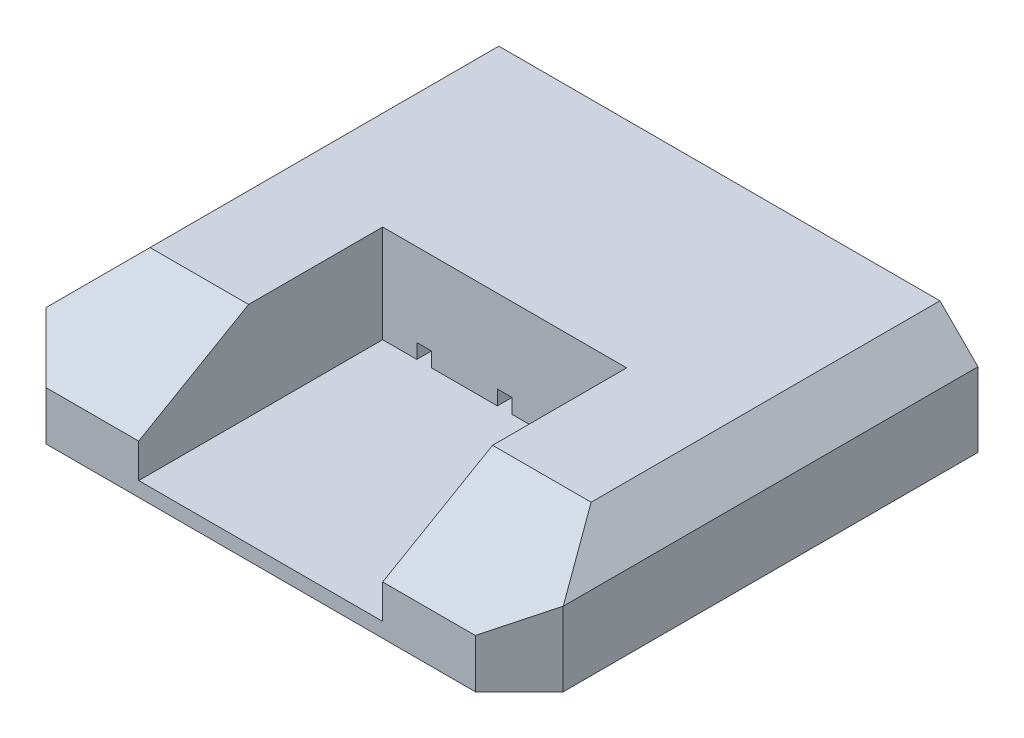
ISO-10303-21;
HEADER;
FILE_DESCRIPTION(('STEP AP214'),'2;1');
FILE_NAME('part.step','',(''),(''),'','','');
FILE_SCHEMA(('AUTOMOTIVE_DESIGN { 1 0 10303 214 1 1 1 1 }'));
ENDSEC;
DATA;
#1=APPLICATION_CONTEXT('core data for automotive mechanical design processes');
#2=APPLICATION_PROTOCOL_DEFINITION('international standard','automotive_design',2000,#1);
#3=PRODUCT_CONTEXT('',#1,'mechanical');
#4=PRODUCT('Part','Part','',(#3));
#5=PRODUCT_RELATED_PRODUCT_CATEGORY('part','',(#4));
#6=PRODUCT_DEFINITION_FORMATION('','',#4);
#7=PRODUCT_DEFINITION_CONTEXT('part definition',#1,'design');
#8=PRODUCT_DEFINITION('design','',#6,#7);
#9=PRODUCT_DEFINITION_SHAPE('','',#8);
#10=(LENGTH_UNIT() NAMED_UNIT(*) SI_UNIT(.MILLI.,.METRE.));
#11=(NAMED_UNIT(*) PLANE_ANGLE_UNIT() SI_UNIT($,.RADIAN.));
#12=(NAMED_UNIT(*) SI_UNIT($,.STERADIAN.) SOLID_ANGLE_UNIT());
#13=UNCERTAINTY_MEASURE_WITH_UNIT(LENGTH_MEASURE(1.E-05),#10,'distance_accuracy_value','');
#14=(GEOMETRIC_REPRESENTATION_CONTEXT(3) GLOBAL_UNCERTAINTY_ASSIGNED_CONTEXT((#13)) GLOBAL_UNIT_ASSIGNED_CONTEXT((#10,
#11,#12)) REPRESENTATION_CONTEXT('',''));
#15=CARTESIAN_POINT('',(0.,0.,0.));
#16=DIRECTION('',(0.,0.,1.));
#17=DIRECTION('',(1.,0.,0.));
#18=AXIS2_PLACEMENT_3D('',#15,#16,#17);
#19=CARTESIAN_POINT('',(530.,230.,470.));
#20=DIRECTION('',(-1.,0.,0.));
#21=DIRECTION('',(0.,0.,1.));
#22=AXIS2_PLACEMENT_3D('',#19,#20,#21);
#23=PLANE('',#22);
#24=DIRECTION('',(0.,-1.,0.));
#25=VECTOR('',#24,1.);
#26=CARTESIAN_POINT('',(530.,230.,-470.));
#27=LINE('',#26,#25);
#28=CARTESIAN_POINT('',(530.,152.,-470.));
#29=VERTEX_POINT('',#28);
#30=CARTESIAN_POINT('',(530.,0.,-470.));
#31=VERTEX_POINT('',#30);
#32=EDGE_CURVE('E359',#29,#31,#27,.T.);
#33=ORIENTED_EDGE('',*,*,#32,.F.);
#34=DIRECTION('',(0.,0.,1.));
#35=VECTOR('',#34,1.);
#36=CARTESIAN_POINT('',(530.,152.,470.));
#37=LINE('',#36,#35);
#38=CARTESIAN_POINT('',(530.,152.,379.933358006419));
#39=VERTEX_POINT('',#38);
#40=EDGE_CURVE('E52',#29,#39,#37,.T.);
#41=ORIENTED_EDGE('',*,*,#40,.T.);
#42=DIRECTION('',(0.,0.500000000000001,-0.866025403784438));
#43=VECTOR('',#42,1.);
#44=CARTESIAN_POINT('',(530.,230.,244.833395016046));
#45=LINE('',#44,#43);
#46=CARTESIAN_POINT('',(530.,151.961524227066,380.));
#47=VERTEX_POINT('',#46);
#48=EDGE_CURVE('E391',#39,#47,#45,.F.);
#49=ORIENTED_EDGE('',*,*,#48,.T.);
#50=DIRECTION('',(0.,-1.,0.));
#51=VECTOR('',#50,1.);
#52=CARTESIAN_POINT('',(530.,230.,380.));
#53=LINE('',#52,#51);
#54=CARTESIAN_POINT('',(530.,0.,380.));
#55=VERTEX_POINT('',#54);
#56=EDGE_CURVE('E373',#47,#55,#53,.T.);
#57=ORIENTED_EDGE('',*,*,#56,.T.);
#58=DIRECTION('',(0.,0.,-1.));
#59=VECTOR('',#58,1.);
#60=CARTESIAN_POINT('',(530.,0.,470.));
#61=LINE('',#60,#59);
#62=EDGE_CURVE('E335',#55,#31,#61,.T.);
#63=ORIENTED_EDGE('',*,*,#62,.T.);
#64=EDGE_LOOP('',(#33,#41,#49,#57,#63));
#65=FACE_BOUND('',#64,.T.);
#66=ADVANCED_FACE('F43',(#65),#23,.F.);
#67=CARTESIAN_POINT('',(-530.,230.,-470.));
#68=DIRECTION('',(0.,0.,1.));
#69=DIRECTION('',(1.,0.,0.));
#70=AXIS2_PLACEMENT_3D('',#67,#68,#69);
#71=PLANE('',#70);
#72=DIRECTION('',(0.,-1.,0.));
#73=VECTOR('',#72,1.);
#74=CARTESIAN_POINT('',(-530.,230.,-470.));
#75=LINE('',#74,#73);
#76=CARTESIAN_POINT('',(-530.,152.,-470.));
#77=VERTEX_POINT('',#76);
#78=CARTESIAN_POINT('',(-530.,0.,-470.));
#79=VERTEX_POINT('',#78);
#80=EDGE_CURVE('E346',#77,#79,#75,.T.);
#81=ORIENTED_EDGE('',*,*,#80,.F.);
#82=DIRECTION('',(-0.707106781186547,-0.707106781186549,0.));
#83=VECTOR('',#82,1.);
#84=CARTESIAN_POINT('',(-452.,230.,-470.));
#85=LINE('',#84,#83);
#86=CARTESIAN_POINT('',(-452.,230.,-470.));
#87=VERTEX_POINT('',#86);
#88=EDGE_CURVE('E409',#77,#87,#85,.F.);
#89=ORIENTED_EDGE('',*,*,#88,.T.);
#90=DIRECTION('',(-1.,0.,0.));
#91=VECTOR('',#90,1.);
#92=CARTESIAN_POINT('',(-530.,230.,-470.));
#93=LINE('',#92,#91);
#94=CARTESIAN_POINT('',(452.,230.,-470.));
#95=VERTEX_POINT('',#94);
#96=EDGE_CURVE('E343',#95,#87,#93,.T.);
#97=ORIENTED_EDGE('',*,*,#96,.F.);
#98=DIRECTION('',(-0.707106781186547,0.707106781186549,0.));
#99=VECTOR('',#98,1.);
#100=CARTESIAN_POINT('',(452.,230.,-470.));
#101=LINE('',#100,#99);
#102=EDGE_CURVE('E407',#95,#29,#101,.F.);
#103=ORIENTED_EDGE('',*,*,#102,.T.);
#104=ORIENTED_EDGE('',*,*,#32,.T.);
#105=DIRECTION('',(-1.,0.,0.));
#106=VECTOR('',#105,1.);
#107=CARTESIAN_POINT('',(-530.,0.,-470.));
#108=LINE('',#107,#106);
#109=EDGE_CURVE('E350',#31,#79,#108,.T.);
#110=ORIENTED_EDGE('',*,*,#109,.T.);
#111=EDGE_LOOP('',(#81,#89,#97,#103,#104,#110));
#112=FACE_BOUND('',#111,.T.);
#113=ADVANCED_FACE('F430',(#112),#71,.F.);
#114=CARTESIAN_POINT('',(-530.,230.,470.));
#115=DIRECTION('',(1.,0.,0.));
#116=DIRECTION('',(0.,0.,-1.));
#117=AXIS2_PLACEMENT_3D('',#114,#115,#116);
#118=PLANE('',#117);
#119=DIRECTION('',(0.,-0.500000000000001,0.866025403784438));
#120=VECTOR('',#119,1.);
#121=CARTESIAN_POINT('',(-530.,230.,244.833395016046));
#122=LINE('',#121,#120);
#123=CARTESIAN_POINT('',(-530.,151.961524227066,380.));
#124=VERTEX_POINT('',#123);
#125=CARTESIAN_POINT('',(-530.,152.,379.933358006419));
#126=VERTEX_POINT('',#125);
#127=EDGE_CURVE('E388',#124,#126,#122,.F.);
#128=ORIENTED_EDGE('',*,*,#127,.T.);
#129=DIRECTION('',(0.,0.,-1.));
#130=VECTOR('',#129,1.);
#131=CARTESIAN_POINT('',(-530.,152.,470.));
#132=LINE('',#131,#130);
#133=EDGE_CURVE('E405',#126,#77,#132,.T.);
#134=ORIENTED_EDGE('',*,*,#133,.T.);
#135=ORIENTED_EDGE('',*,*,#80,.T.);
#136=DIRECTION('',(0.,0.,1.));
#137=VECTOR('',#136,1.);
#138=CARTESIAN_POINT('',(-530.,0.,470.));
#139=LINE('',#138,#137);
#140=CARTESIAN_POINT('',(-530.,0.,380.));
#141=VERTEX_POINT('',#140);
#142=EDGE_CURVE('E353',#79,#141,#139,.T.);
#143=ORIENTED_EDGE('',*,*,#142,.T.);
#144=DIRECTION('',(0.,1.,0.));
#145=VECTOR('',#144,1.);
#146=CARTESIAN_POINT('',(-530.,230.,380.));
#147=LINE('',#146,#145);
#148=EDGE_CURVE('E370',#141,#124,#147,.T.);
#149=ORIENTED_EDGE('',*,*,#148,.T.);
#150=EDGE_LOOP('',(#128,#134,#135,#143,#149));
#151=FACE_BOUND('',#150,.T.);
#152=ADVANCED_FACE('F473',(#151),#118,.F.);
#153=CARTESIAN_POINT('',(-530.,230.,470.));
#154=DIRECTION('',(0.,0.,-1.));
#155=DIRECTION('',(-1.,0.,0.));
#156=AXIS2_PLACEMENT_3D('',#153,#154,#155);
#157=PLANE('',#156);
#158=DIRECTION('',(0.,1.,0.));
#159=VECTOR('',#158,1.);
#160=CARTESIAN_POINT('',(-250.,30.,470.));
#161=LINE('',#160,#159);
#162=CARTESIAN_POINT('',(-250.,30.,470.));
#163=VERTEX_POINT('',#162);
#164=CARTESIAN_POINT('',(-250.,99.9999999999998,470.));
#165=VERTEX_POINT('',#164);
#166=EDGE_CURVE('E336',#163,#165,#161,.T.);
#167=ORIENTED_EDGE('',*,*,#166,.T.);
#168=DIRECTION('',(-1.,0.,0.));
#169=VECTOR('',#168,1.);
#170=CARTESIAN_POINT('',(-530.,99.9999999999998,470.));
#171=LINE('',#170,#169);
#172=CARTESIAN_POINT('',(-440.,99.9999999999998,470.));
#173=VERTEX_POINT('',#172);
#174=EDGE_CURVE('E384',#165,#173,#171,.T.);
#175=ORIENTED_EDGE('',*,*,#174,.T.);
#176=DIRECTION('',(0.,-1.,0.));
#177=VECTOR('',#176,1.);
#178=CARTESIAN_POINT('',(-440.,230.,470.));
#179=LINE('',#178,#177);
#180=CARTESIAN_POINT('',(-440.,0.,470.));
#181=VERTEX_POINT('',#180);
#182=EDGE_CURVE('E364',#173,#181,#179,.T.);
#183=ORIENTED_EDGE('',*,*,#182,.T.);
#184=DIRECTION('',(1.,0.,0.));
#185=VECTOR('',#184,1.);
#186=CARTESIAN_POINT('',(-530.,0.,470.));
#187=LINE('',#186,#185);
#188=CARTESIAN_POINT('',(440.,0.,470.));
#189=VERTEX_POINT('',#188);
#190=EDGE_CURVE('E347',#181,#189,#187,.T.);
#191=ORIENTED_EDGE('',*,*,#190,.T.);
#192=DIRECTION('',(0.,1.,0.));
#193=VECTOR('',#192,1.);
#194=CARTESIAN_POINT('',(440.,230.,470.));
#195=LINE('',#194,#193);
#196=CARTESIAN_POINT('',(440.,99.9999999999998,470.));
#197=VERTEX_POINT('',#196);
#198=EDGE_CURVE('E361',#189,#197,#195,.T.);
#199=ORIENTED_EDGE('',*,*,#198,.T.);
#200=DIRECTION('',(-1.,0.,0.));
#201=VECTOR('',#200,1.);
#202=CARTESIAN_POINT('',(-530.,99.9999999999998,470.));
#203=LINE('',#202,#201);
#204=CARTESIAN_POINT('',(250.,99.9999999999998,470.));
#205=VERTEX_POINT('',#204);
#206=EDGE_CURVE('E382',#197,#205,#203,.T.);
#207=ORIENTED_EDGE('',*,*,#206,.T.);
#208=DIRECTION('',(0.,1.,0.));
#209=VECTOR('',#208,1.);
#210=CARTESIAN_POINT('',(250.,30.,470.));
#211=LINE('',#210,#209);
#212=CARTESIAN_POINT('',(250.,30.,470.));
#213=VERTEX_POINT('',#212);
#214=EDGE_CURVE('E332',#213,#205,#211,.T.);
#215=ORIENTED_EDGE('',*,*,#214,.F.);
#216=DIRECTION('',(1.,0.,0.));
#217=VECTOR('',#216,1.);
#218=CARTESIAN_POINT('',(-250.,30.,470.));
#219=LINE('',#218,#217);
#220=EDGE_CURVE('E322',#163,#213,#219,.T.);
#221=ORIENTED_EDGE('',*,*,#220,.F.);
#222=EDGE_LOOP('',(#167,#175,#183,#191,#199,#207,#215,#221));
#223=FACE_BOUND('',#222,.T.);
#224=ADVANCED_FACE('F458',(#223),#157,.F.);
#225=CARTESIAN_POINT('',(0.,230.,0.));
#226=DIRECTION('',(0.,-1.,0.));
#227=DIRECTION('',(0.,0.,-1.));
#228=AXIS2_PLACEMENT_3D('',#225,#226,#227);
#229=PLANE('',#228);
#230=ORIENTED_EDGE('',*,*,#96,.T.);
#231=DIRECTION('',(0.,0.,1.));
#232=VECTOR('',#231,1.);
#233=CARTESIAN_POINT('',(-452.,230.,0.));
#234=LINE('',#233,#232);
#235=CARTESIAN_POINT('',(-452.,230.,244.833395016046));
#236=VERTEX_POINT('',#235);
#237=EDGE_CURVE('E400',#87,#236,#234,.T.);
#238=ORIENTED_EDGE('',*,*,#237,.T.);
#239=DIRECTION('',(1.,0.,0.));
#240=VECTOR('',#239,1.);
#241=CARTESIAN_POINT('',(0.,230.,244.833395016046));
#242=LINE('',#241,#240);
#243=CARTESIAN_POINT('',(-250.,230.,244.833395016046));
#244=VERTEX_POINT('',#243);
#245=EDGE_CURVE('E378',#236,#244,#242,.T.);
#246=ORIENTED_EDGE('',*,*,#245,.T.);
#247=DIRECTION('',(0.,0.,1.));
#248=VECTOR('',#247,1.);
#249=CARTESIAN_POINT('',(-250.,230.,470.));
#250=LINE('',#249,#248);
#251=CARTESIAN_POINT('',(-250.,230.,-29.9999999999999));
#252=VERTEX_POINT('',#251);
#253=EDGE_CURVE('E314',#252,#244,#250,.T.);
#254=ORIENTED_EDGE('',*,*,#253,.F.);
#255=DIRECTION('',(-1.,0.,0.));
#256=VECTOR('',#255,1.);
#257=CARTESIAN_POINT('',(-250.,230.,-29.9999999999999));
#258=LINE('',#257,#256);
#259=CARTESIAN_POINT('',(250.,230.,-29.9999999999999));
#260=VERTEX_POINT('',#259);
#261=EDGE_CURVE('E327',#260,#252,#258,.T.);
#262=ORIENTED_EDGE('',*,*,#261,.F.);
#263=DIRECTION('',(0.,0.,-1.));
#264=VECTOR('',#263,1.);
#265=CARTESIAN_POINT('',(250.,230.,470.));
#266=LINE('',#265,#264);
#267=CARTESIAN_POINT('',(250.,230.,244.833395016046));
#268=VERTEX_POINT('',#267);
#269=EDGE_CURVE('E251',#268,#260,#266,.T.);
#270=ORIENTED_EDGE('',*,*,#269,.F.);
#271=DIRECTION('',(1.,0.,0.));
#272=VECTOR('',#271,1.);
#273=CARTESIAN_POINT('',(0.,230.,244.833395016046));
#274=LINE('',#273,#272);
#275=CARTESIAN_POINT('',(452.,230.,244.833395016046));
#276=VERTEX_POINT('',#275);
#277=EDGE_CURVE('E375',#268,#276,#274,.T.);
#278=ORIENTED_EDGE('',*,*,#277,.T.);
#279=DIRECTION('',(0.,0.,-1.));
#280=VECTOR('',#279,1.);
#281=CARTESIAN_POINT('',(452.,230.,0.));
#282=LINE('',#281,#280);
#283=EDGE_CURVE('E397',#276,#95,#282,.T.);
#284=ORIENTED_EDGE('',*,*,#283,.T.);
#285=EDGE_LOOP('',(#230,#238,#246,#254,#262,#270,#278,#284));
#286=FACE_BOUND('',#285,.T.);
#287=ADVANCED_FACE('F425',(#286),#229,.F.);
#288=CARTESIAN_POINT('',(0.,0.,0.));
#289=DIRECTION('',(0.,-1.,0.));
#290=DIRECTION('',(0.,0.,-1.));
#291=AXIS2_PLACEMENT_3D('',#288,#289,#290);
#292=PLANE('',#291);
#293=ORIENTED_EDGE('',*,*,#190,.F.);
#294=DIRECTION('',(0.707106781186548,0.,0.707106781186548));
#295=VECTOR('',#294,1.);
#296=CARTESIAN_POINT('',(-455.,0.,455.));
#297=LINE('',#296,#295);
#298=EDGE_CURVE('E368',#181,#141,#297,.F.);
#299=ORIENTED_EDGE('',*,*,#298,.T.);
#300=ORIENTED_EDGE('',*,*,#142,.F.);
#301=ORIENTED_EDGE('',*,*,#109,.F.);
#302=ORIENTED_EDGE('',*,*,#62,.F.);
#303=DIRECTION('',(0.707106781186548,0.,-0.707106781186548));
#304=VECTOR('',#303,1.);
#305=CARTESIAN_POINT('',(455.,0.,455.));
#306=LINE('',#305,#304);
#307=EDGE_CURVE('E366',#55,#189,#306,.F.);
#308=ORIENTED_EDGE('',*,*,#307,.T.);
#309=EDGE_LOOP('',(#293,#299,#300,#301,#302,#308));
#310=FACE_BOUND('',#309,.T.);
#311=ADVANCED_FACE('F469',(#310),#292,.T.);
#312=CARTESIAN_POINT('',(250.,30.,470.));
#313=DIRECTION('',(1.,0.,0.));
#314=DIRECTION('',(0.,0.,-1.));
#315=AXIS2_PLACEMENT_3D('',#312,#313,#314);
#316=PLANE('',#315);
#317=ORIENTED_EDGE('',*,*,#214,.T.);
#318=DIRECTION('',(0.,-0.500000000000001,0.866025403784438));
#319=VECTOR('',#318,1.);
#320=CARTESIAN_POINT('',(250.,230.,244.833395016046));
#321=LINE('',#320,#319);
#322=EDGE_CURVE('E395',#205,#268,#321,.F.);
#323=ORIENTED_EDGE('',*,*,#322,.T.);
#324=ORIENTED_EDGE('',*,*,#269,.T.);
#325=DIRECTION('',(0.,1.,0.));
#326=VECTOR('',#325,1.);
#327=CARTESIAN_POINT('',(250.,30.,-29.9999999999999));
#328=LINE('',#327,#326);
#329=CARTESIAN_POINT('',(250.,30.,-29.9999999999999));
#330=VERTEX_POINT('',#329);
#331=EDGE_CURVE('E325',#330,#260,#328,.T.);
#332=ORIENTED_EDGE('',*,*,#331,.F.);
#333=DIRECTION('',(0.,0.,-1.));
#334=VECTOR('',#333,1.);
#335=CARTESIAN_POINT('',(250.,30.,470.));
#336=LINE('',#335,#334);
#337=EDGE_CURVE('E310',#213,#330,#336,.T.);
#338=ORIENTED_EDGE('',*,*,#337,.F.);
#339=EDGE_LOOP('',(#317,#323,#324,#332,#338));
#340=FACE_BOUND('',#339,.T.);
#341=ADVANCED_FACE('F454',(#340),#316,.F.);
#342=CARTESIAN_POINT('',(-250.,30.,470.));
#343=DIRECTION('',(-1.,0.,0.));
#344=DIRECTION('',(0.,0.,1.));
#345=AXIS2_PLACEMENT_3D('',#342,#343,#344);
#346=PLANE('',#345);
#347=ORIENTED_EDGE('',*,*,#253,.T.);
#348=DIRECTION('',(0.,0.500000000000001,-0.866025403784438));
#349=VECTOR('',#348,1.);
#350=CARTESIAN_POINT('',(-250.,230.,244.833395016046));
#351=LINE('',#350,#349);
#352=EDGE_CURVE('E380',#244,#165,#351,.F.);
#353=ORIENTED_EDGE('',*,*,#352,.T.);
#354=ORIENTED_EDGE('',*,*,#166,.F.);
#355=DIRECTION('',(0.,0.,1.));
#356=VECTOR('',#355,1.);
#357=CARTESIAN_POINT('',(-250.,30.,470.));
#358=LINE('',#357,#356);
#359=CARTESIAN_POINT('',(-250.,30.,-29.9999999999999));
#360=VERTEX_POINT('',#359);
#361=EDGE_CURVE('E318',#360,#163,#358,.T.);
#362=ORIENTED_EDGE('',*,*,#361,.F.);
#363=DIRECTION('',(0.,1.,0.));
#364=VECTOR('',#363,1.);
#365=CARTESIAN_POINT('',(-250.,30.,-29.9999999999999));
#366=LINE('',#365,#364);
#367=EDGE_CURVE('E339',#360,#252,#366,.T.);
#368=ORIENTED_EDGE('',*,*,#367,.T.);
#369=EDGE_LOOP('',(#347,#353,#354,#362,#368));
#370=FACE_BOUND('',#369,.T.);
#371=ADVANCED_FACE('F444',(#370),#346,.F.);
#372=CARTESIAN_POINT('',(-250.,30.,-29.9999999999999));
#373=DIRECTION('',(0.,0.,-1.));
#374=DIRECTION('',(-1.,0.,0.));
#375=AXIS2_PLACEMENT_3D('',#372,#373,#374);
#376=PLANE('',#375);
#377=DIRECTION('',(-1.,0.,0.));
#378=VECTOR('',#377,1.);
#379=CARTESIAN_POINT('',(-180.,60.,-29.9999999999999));
#380=LINE('',#379,#378);
#381=CARTESIAN_POINT('',(-150.,60.,-29.9999999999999));
#382=VERTEX_POINT('',#381);
#383=CARTESIAN_POINT('',(-180.,60.,-29.9999999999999));
#384=VERTEX_POINT('',#383);
#385=EDGE_CURVE('E241',#382,#384,#380,.T.);
#386=ORIENTED_EDGE('',*,*,#385,.F.);
#387=DIRECTION('',(0.,1.,0.));
#388=VECTOR('',#387,1.);
#389=CARTESIAN_POINT('',(-150.,30.,-29.9999999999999));
#390=LINE('',#389,#388);
#391=CARTESIAN_POINT('',(-150.,30.,-29.9999999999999));
#392=VERTEX_POINT('',#391);
#393=EDGE_CURVE('E223',#392,#382,#390,.T.);
#394=ORIENTED_EDGE('',*,*,#393,.F.);
#395=DIRECTION('',(-1.,0.,0.));
#396=VECTOR('',#395,1.);
#397=CARTESIAN_POINT('',(-250.,30.,-29.9999999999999));
#398=LINE('',#397,#396);
#399=CARTESIAN_POINT('',(-15.,30.,-29.9999999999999));
#400=VERTEX_POINT('',#399);
#401=EDGE_CURVE('E479',#400,#392,#398,.T.);
#402=ORIENTED_EDGE('',*,*,#401,.F.);
#403=DIRECTION('',(0.,-1.,0.));
#404=VECTOR('',#403,1.);
#405=CARTESIAN_POINT('',(-15.,30.,-29.9999999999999));
#406=LINE('',#405,#404);
#407=CARTESIAN_POINT('',(-15.,60.,-29.9999999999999));
#408=VERTEX_POINT('',#407);
#409=EDGE_CURVE('E67',#408,#400,#406,.T.);
#410=ORIENTED_EDGE('',*,*,#409,.F.);
#411=DIRECTION('',(-1.,0.,0.));
#412=VECTOR('',#411,1.);
#413=CARTESIAN_POINT('',(-15.,60.,-29.9999999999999));
#414=LINE('',#413,#412);
#415=CARTESIAN_POINT('',(15.,60.,-29.9999999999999));
#416=VERTEX_POINT('',#415);
#417=EDGE_CURVE('E247',#416,#408,#414,.T.);
#418=ORIENTED_EDGE('',*,*,#417,.F.);
#419=DIRECTION('',(0.,1.,0.));
#420=VECTOR('',#419,1.);
#421=CARTESIAN_POINT('',(15.,30.,-29.9999999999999));
#422=LINE('',#421,#420);
#423=CARTESIAN_POINT('',(15.,30.,-29.9999999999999));
#424=VERTEX_POINT('',#423);
#425=EDGE_CURVE('E265',#424,#416,#422,.T.);
#426=ORIENTED_EDGE('',*,*,#425,.F.);
#427=CARTESIAN_POINT('',(150.,30.,-29.9999999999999));
#428=VERTEX_POINT('',#427);
#429=EDGE_CURVE('E319',#428,#424,#398,.T.);
#430=ORIENTED_EDGE('',*,*,#429,.F.);
#431=DIRECTION('',(0.,-1.,0.));
#432=VECTOR('',#431,1.);
#433=CARTESIAN_POINT('',(150.,30.,-29.9999999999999));
#434=LINE('',#433,#432);
#435=CARTESIAN_POINT('',(150.,60.,-29.9999999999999));
#436=VERTEX_POINT('',#435);
#437=EDGE_CURVE('E295',#436,#428,#434,.T.);
#438=ORIENTED_EDGE('',*,*,#437,.F.);
#439=DIRECTION('',(-1.,0.,0.));
#440=VECTOR('',#439,1.);
#441=CARTESIAN_POINT('',(150.,60.,-29.9999999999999));
#442=LINE('',#441,#440);
#443=CARTESIAN_POINT('',(180.,60.,-29.9999999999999));
#444=VERTEX_POINT('',#443);
#445=EDGE_CURVE('E264',#444,#436,#442,.T.);
#446=ORIENTED_EDGE('',*,*,#445,.F.);
#447=DIRECTION('',(0.,1.,0.));
#448=VECTOR('',#447,1.);
#449=CARTESIAN_POINT('',(180.,30.,-29.9999999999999));
#450=LINE('',#449,#448);
#451=CARTESIAN_POINT('',(180.,30.,-29.9999999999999));
#452=VERTEX_POINT('',#451);
#453=EDGE_CURVE('E292',#452,#444,#450,.T.);
#454=ORIENTED_EDGE('',*,*,#453,.F.);
#455=EDGE_CURVE('E315',#330,#452,#398,.T.);
#456=ORIENTED_EDGE('',*,*,#455,.F.);
#457=ORIENTED_EDGE('',*,*,#331,.T.);
#458=ORIENTED_EDGE('',*,*,#261,.T.);
#459=ORIENTED_EDGE('',*,*,#367,.F.);
#460=CARTESIAN_POINT('',(-180.,30.,-29.9999999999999));
#461=VERTEX_POINT('',#460);
#462=EDGE_CURVE('E313',#461,#360,#398,.T.);
#463=ORIENTED_EDGE('',*,*,#462,.F.);
#464=DIRECTION('',(0.,-1.,0.));
#465=VECTOR('',#464,1.);
#466=CARTESIAN_POINT('',(-180.,30.,-29.9999999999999));
#467=LINE('',#466,#465);
#468=EDGE_CURVE('E59',#384,#461,#467,.T.);
#469=ORIENTED_EDGE('',*,*,#468,.F.);
#470=EDGE_LOOP('',(#386,#394,#402,#410,#418,#426,#430,#438,#446,#454,#456,#457,#458,#459,#463,#469));
#471=FACE_BOUND('',#470,.T.);
#472=ADVANCED_FACE('F449',(#471),#376,.F.);
#473=CARTESIAN_POINT('',(0.,30.,0.));
#474=DIRECTION('',(0.,-1.,0.));
#475=DIRECTION('',(0.,0.,-1.));
#476=AXIS2_PLACEMENT_3D('',#473,#474,#475);
#477=PLANE('',#476);
#478=ORIENTED_EDGE('',*,*,#337,.T.);
#479=ORIENTED_EDGE('',*,*,#455,.T.);
#480=DIRECTION('',(0.,0.,1.));
#481=VECTOR('',#480,1.);
#482=CARTESIAN_POINT('',(180.,30.,-79.9999999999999));
#483=LINE('',#482,#481);
#484=CARTESIAN_POINT('',(180.,30.,-79.9999999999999));
#485=VERTEX_POINT('',#484);
#486=EDGE_CURVE('E288',#485,#452,#483,.T.);
#487=ORIENTED_EDGE('',*,*,#486,.F.);
#488=DIRECTION('',(1.,0.,0.));
#489=VECTOR('',#488,1.);
#490=CARTESIAN_POINT('',(150.,30.,-79.9999999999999));
#491=LINE('',#490,#489);
#492=CARTESIAN_POINT('',(150.,30.,-79.9999999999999));
#493=VERTEX_POINT('',#492);
#494=EDGE_CURVE('E302',#493,#485,#491,.T.);
#495=ORIENTED_EDGE('',*,*,#494,.F.);
#496=DIRECTION('',(0.,0.,1.));
#497=VECTOR('',#496,1.);
#498=CARTESIAN_POINT('',(150.,30.,-79.9999999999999));
#499=LINE('',#498,#497);
#500=EDGE_CURVE('E285',#493,#428,#499,.T.);
#501=ORIENTED_EDGE('',*,*,#500,.T.);
#502=ORIENTED_EDGE('',*,*,#429,.T.);
#503=DIRECTION('',(0.,0.,1.));
#504=VECTOR('',#503,1.);
#505=CARTESIAN_POINT('',(15.,30.,-79.9999999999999));
#506=LINE('',#505,#504);
#507=CARTESIAN_POINT('',(15.,30.,-79.9999999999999));
#508=VERTEX_POINT('',#507);
#509=EDGE_CURVE('E260',#508,#424,#506,.T.);
#510=ORIENTED_EDGE('',*,*,#509,.F.);
#511=DIRECTION('',(1.,0.,0.));
#512=VECTOR('',#511,1.);
#513=CARTESIAN_POINT('',(-15.,30.,-79.9999999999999));
#514=LINE('',#513,#512);
#515=CARTESIAN_POINT('',(-15.,30.,-79.9999999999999));
#516=VERTEX_POINT('',#515);
#517=EDGE_CURVE('E274',#516,#508,#514,.T.);
#518=ORIENTED_EDGE('',*,*,#517,.F.);
#519=DIRECTION('',(0.,0.,1.));
#520=VECTOR('',#519,1.);
#521=CARTESIAN_POINT('',(-15.,30.,-79.9999999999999));
#522=LINE('',#521,#520);
#523=EDGE_CURVE('E258',#516,#400,#522,.T.);
#524=ORIENTED_EDGE('',*,*,#523,.T.);
#525=ORIENTED_EDGE('',*,*,#401,.T.);
#526=DIRECTION('',(0.,0.,1.));
#527=VECTOR('',#526,1.);
#528=CARTESIAN_POINT('',(-150.,30.,-79.9999999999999));
#529=LINE('',#528,#527);
#530=CARTESIAN_POINT('',(-150.,30.,-79.9999999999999));
#531=VERTEX_POINT('',#530);
#532=EDGE_CURVE('E249',#531,#392,#529,.T.);
#533=ORIENTED_EDGE('',*,*,#532,.F.);
#534=DIRECTION('',(1.,0.,0.));
#535=VECTOR('',#534,1.);
#536=CARTESIAN_POINT('',(-180.,30.,-79.9999999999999));
#537=LINE('',#536,#535);
#538=CARTESIAN_POINT('',(-180.,30.,-79.9999999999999));
#539=VERTEX_POINT('',#538);
#540=EDGE_CURVE('E228',#539,#531,#537,.T.);
#541=ORIENTED_EDGE('',*,*,#540,.F.);
#542=DIRECTION('',(0.,0.,1.));
#543=VECTOR('',#542,1.);
#544=CARTESIAN_POINT('',(-180.,30.,-79.9999999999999));
#545=LINE('',#544,#543);
#546=EDGE_CURVE('E252',#539,#461,#545,.T.);
#547=ORIENTED_EDGE('',*,*,#546,.T.);
#548=ORIENTED_EDGE('',*,*,#462,.T.);
#549=ORIENTED_EDGE('',*,*,#361,.T.);
#550=ORIENTED_EDGE('',*,*,#220,.T.);
#551=EDGE_LOOP('',(#478,#479,#487,#495,#501,#502,#510,#518,#524,#525,#533,#541,#547,#548,#549,#550));
#552=FACE_BOUND('',#551,.T.);
#553=ADVANCED_FACE('F478',(#552),#477,.F.);
#554=CARTESIAN_POINT('',(-440.,230.,470.));
#555=DIRECTION('',(0.707106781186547,0.,-0.707106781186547));
#556=DIRECTION('',(0.,-1.,0.));
#557=AXIS2_PLACEMENT_3D('',#554,#555,#556);
#558=PLANE('',#557);
#559=ORIENTED_EDGE('',*,*,#182,.F.);
#560=DIRECTION('',(-0.654653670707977,0.377964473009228,-0.654653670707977));
#561=VECTOR('',#560,1.);
#562=CARTESIAN_POINT('',(-472.166657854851,118.571428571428,437.833342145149));
#563=LINE('',#562,#561);
#564=EDGE_CURVE('E386',#173,#124,#563,.T.);
#565=ORIENTED_EDGE('',*,*,#564,.T.);
#566=ORIENTED_EDGE('',*,*,#148,.F.);
#567=ORIENTED_EDGE('',*,*,#298,.F.);
#568=EDGE_LOOP('',(#559,#565,#566,#567));
#569=FACE_BOUND('',#568,.T.);
#570=ADVANCED_FACE('F476',(#569),#558,.F.);
#571=CARTESIAN_POINT('',(530.,230.,380.));
#572=DIRECTION('',(-0.707106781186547,0.,-0.707106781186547));
#573=DIRECTION('',(0.,-1.,0.));
#574=AXIS2_PLACEMENT_3D('',#571,#572,#573);
#575=PLANE('',#574);
#576=ORIENTED_EDGE('',*,*,#56,.F.);
#577=DIRECTION('',(-0.654653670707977,-0.377964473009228,0.654653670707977));
#578=VECTOR('',#577,1.);
#579=CARTESIAN_POINT('',(549.309514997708,163.109877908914,360.690485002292));
#580=LINE('',#579,#578);
#581=EDGE_CURVE('E393',#47,#197,#580,.T.);
#582=ORIENTED_EDGE('',*,*,#581,.T.);
#583=ORIENTED_EDGE('',*,*,#198,.F.);
#584=ORIENTED_EDGE('',*,*,#307,.F.);
#585=EDGE_LOOP('',(#576,#582,#583,#584));
#586=FACE_BOUND('',#585,.T.);
#587=ADVANCED_FACE('F464',(#586),#575,.F.);
#588=CARTESIAN_POINT('',(0.,230.,244.833395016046));
#589=DIRECTION('',(0.,-0.866025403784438,-0.500000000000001));
#590=DIRECTION('',(1.,0.,0.));
#591=AXIS2_PLACEMENT_3D('',#588,#589,#590);
#592=PLANE('',#591);
#593=ORIENTED_EDGE('',*,*,#245,.F.);
#594=DIRECTION('',(-0.447213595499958,-0.447213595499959,0.774596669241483));
#595=VECTOR('',#594,1.);
#596=CARTESIAN_POINT('',(-361.6,320.4,88.2560020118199));
#597=LINE('',#596,#595);
#598=EDGE_CURVE('E403',#236,#126,#597,.T.);
#599=ORIENTED_EDGE('',*,*,#598,.T.);
#600=ORIENTED_EDGE('',*,*,#127,.F.);
#601=ORIENTED_EDGE('',*,*,#564,.F.);
#602=ORIENTED_EDGE('',*,*,#174,.F.);
#603=ORIENTED_EDGE('',*,*,#352,.F.);
#604=EDGE_LOOP('',(#593,#599,#600,#601,#602,#603));
#605=FACE_BOUND('',#604,.T.);
#606=ADVANCED_FACE('F439',(#605),#592,.F.);
#607=CARTESIAN_POINT('',(0.,230.,244.833395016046));
#608=DIRECTION('',(0.,-0.866025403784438,-0.500000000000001));
#609=DIRECTION('',(1.,0.,0.));
#610=AXIS2_PLACEMENT_3D('',#607,#608,#609);
#611=PLANE('',#610);
#612=ORIENTED_EDGE('',*,*,#48,.F.);
#613=DIRECTION('',(-0.447213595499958,0.447213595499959,-0.774596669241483));
#614=VECTOR('',#613,1.);
#615=CARTESIAN_POINT('',(361.6,320.4,88.25600201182));
#616=LINE('',#615,#614);
#617=EDGE_CURVE('E11',#39,#276,#616,.T.);
#618=ORIENTED_EDGE('',*,*,#617,.T.);
#619=ORIENTED_EDGE('',*,*,#277,.F.);
#620=ORIENTED_EDGE('',*,*,#322,.F.);
#621=ORIENTED_EDGE('',*,*,#206,.F.);
#622=ORIENTED_EDGE('',*,*,#581,.F.);
#623=EDGE_LOOP('',(#612,#618,#619,#620,#621,#622));
#624=FACE_BOUND('',#623,.T.);
#625=ADVANCED_FACE('F419',(#624),#611,.F.);
#626=CARTESIAN_POINT('',(-452.,230.,0.));
#627=DIRECTION('',(0.707106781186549,-0.707106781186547,0.));
#628=DIRECTION('',(0.,0.,1.));
#629=AXIS2_PLACEMENT_3D('',#626,#627,#628);
#630=PLANE('',#629);
#631=ORIENTED_EDGE('',*,*,#88,.F.);
#632=ORIENTED_EDGE('',*,*,#133,.F.);
#633=ORIENTED_EDGE('',*,*,#598,.F.);
#634=ORIENTED_EDGE('',*,*,#237,.F.);
#635=EDGE_LOOP('',(#631,#632,#633,#634));
#636=FACE_BOUND('',#635,.T.);
#637=ADVANCED_FACE('F434',(#636),#630,.F.);
#638=CARTESIAN_POINT('',(452.,230.,0.));
#639=DIRECTION('',(-0.707106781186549,-0.707106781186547,0.));
#640=DIRECTION('',(0.,0.,-1.));
#641=AXIS2_PLACEMENT_3D('',#638,#639,#640);
#642=PLANE('',#641);
#643=ORIENTED_EDGE('',*,*,#617,.F.);
#644=ORIENTED_EDGE('',*,*,#40,.F.);
#645=ORIENTED_EDGE('',*,*,#102,.F.);
#646=ORIENTED_EDGE('',*,*,#283,.F.);
#647=EDGE_LOOP('',(#643,#644,#645,#646));
#648=FACE_BOUND('',#647,.T.);
#649=ADVANCED_FACE('F46',(#648),#642,.F.);
#650=CARTESIAN_POINT('',(150.,60.,-79.9999999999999));
#651=DIRECTION('',(0.,1.,0.));
#652=DIRECTION('',(0.,0.,1.));
#653=AXIS2_PLACEMENT_3D('',#650,#651,#652);
#654=PLANE('',#653);
#655=ORIENTED_EDGE('',*,*,#445,.T.);
#656=DIRECTION('',(0.,0.,1.));
#657=VECTOR('',#656,1.);
#658=CARTESIAN_POINT('',(150.,60.,-79.9999999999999));
#659=LINE('',#658,#657);
#660=CARTESIAN_POINT('',(150.,60.,-79.9999999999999));
#661=VERTEX_POINT('',#660);
#662=EDGE_CURVE('E282',#661,#436,#659,.T.);
#663=ORIENTED_EDGE('',*,*,#662,.F.);
#664=DIRECTION('',(-1.,0.,0.));
#665=VECTOR('',#664,1.);
#666=CARTESIAN_POINT('',(150.,60.,-79.9999999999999));
#667=LINE('',#666,#665);
#668=CARTESIAN_POINT('',(180.,60.,-79.9999999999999));
#669=VERTEX_POINT('',#668);
#670=EDGE_CURVE('E296',#669,#661,#667,.T.);
#671=ORIENTED_EDGE('',*,*,#670,.F.);
#672=DIRECTION('',(0.,0.,1.));
#673=VECTOR('',#672,1.);
#674=CARTESIAN_POINT('',(180.,60.,-79.9999999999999));
#675=LINE('',#674,#673);
#676=EDGE_CURVE('E290',#669,#444,#675,.T.);
#677=ORIENTED_EDGE('',*,*,#676,.T.);
#678=EDGE_LOOP('',(#655,#663,#671,#677));
#679=FACE_BOUND('',#678,.T.);
#680=ADVANCED_FACE('F547',(#679),#654,.F.);
#681=CARTESIAN_POINT('',(180.,30.,-79.9999999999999));
#682=DIRECTION('',(1.,0.,0.));
#683=DIRECTION('',(0.,1.,0.));
#684=AXIS2_PLACEMENT_3D('',#681,#682,#683);
#685=PLANE('',#684);
#686=ORIENTED_EDGE('',*,*,#453,.T.);
#687=ORIENTED_EDGE('',*,*,#676,.F.);
#688=DIRECTION('',(0.,1.,0.));
#689=VECTOR('',#688,1.);
#690=CARTESIAN_POINT('',(180.,30.,-79.9999999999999));
#691=LINE('',#690,#689);
#692=EDGE_CURVE('E284',#485,#669,#691,.T.);
#693=ORIENTED_EDGE('',*,*,#692,.F.);
#694=ORIENTED_EDGE('',*,*,#486,.T.);
#695=EDGE_LOOP('',(#686,#687,#693,#694));
#696=FACE_BOUND('',#695,.T.);
#697=ADVANCED_FACE('F552',(#696),#685,.F.);
#698=CARTESIAN_POINT('',(150.,30.,-79.9999999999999));
#699=DIRECTION('',(-1.,0.,0.));
#700=DIRECTION('',(0.,0.,1.));
#701=AXIS2_PLACEMENT_3D('',#698,#699,#700);
#702=PLANE('',#701);
#703=ORIENTED_EDGE('',*,*,#437,.T.);
#704=ORIENTED_EDGE('',*,*,#500,.F.);
#705=DIRECTION('',(0.,-1.,0.));
#706=VECTOR('',#705,1.);
#707=CARTESIAN_POINT('',(150.,30.,-79.9999999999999));
#708=LINE('',#707,#706);
#709=EDGE_CURVE('E305',#661,#493,#708,.T.);
#710=ORIENTED_EDGE('',*,*,#709,.F.);
#711=ORIENTED_EDGE('',*,*,#662,.T.);
#712=EDGE_LOOP('',(#703,#704,#710,#711));
#713=FACE_BOUND('',#712,.T.);
#714=ADVANCED_FACE('F508',(#713),#702,.F.);
#715=CARTESIAN_POINT('',(0.,0.,-79.9999999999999));
#716=DIRECTION('',(0.,0.,1.));
#717=DIRECTION('',(1.,0.,0.));
#718=AXIS2_PLACEMENT_3D('',#715,#716,#717);
#719=PLANE('',#718);
#720=ORIENTED_EDGE('',*,*,#670,.T.);
#721=ORIENTED_EDGE('',*,*,#709,.T.);
#722=ORIENTED_EDGE('',*,*,#494,.T.);
#723=ORIENTED_EDGE('',*,*,#692,.T.);
#724=EDGE_LOOP('',(#720,#721,#722,#723));
#725=FACE_BOUND('',#724,.T.);
#726=ADVANCED_FACE('F501',(#725),#719,.T.);
#727=CARTESIAN_POINT('',(-15.,60.,-79.9999999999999));
#728=DIRECTION('',(0.,1.,0.));
#729=DIRECTION('',(0.,0.,1.));
#730=AXIS2_PLACEMENT_3D('',#727,#728,#729);
#731=PLANE('',#730);
#732=ORIENTED_EDGE('',*,*,#417,.T.);
#733=DIRECTION('',(0.,0.,1.));
#734=VECTOR('',#733,1.);
#735=CARTESIAN_POINT('',(-15.,60.,-79.9999999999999));
#736=LINE('',#735,#734);
#737=CARTESIAN_POINT('',(-15.,60.,-79.9999999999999));
#738=VERTEX_POINT('',#737);
#739=EDGE_CURVE('E255',#738,#408,#736,.T.);
#740=ORIENTED_EDGE('',*,*,#739,.F.);
#741=DIRECTION('',(-1.,0.,0.));
#742=VECTOR('',#741,1.);
#743=CARTESIAN_POINT('',(-15.,60.,-79.9999999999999));
#744=LINE('',#743,#742);
#745=CARTESIAN_POINT('',(15.,60.,-79.9999999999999));
#746=VERTEX_POINT('',#745);
#747=EDGE_CURVE('E268',#746,#738,#744,.T.);
#748=ORIENTED_EDGE('',*,*,#747,.F.);
#749=DIRECTION('',(0.,0.,1.));
#750=VECTOR('',#749,1.);
#751=CARTESIAN_POINT('',(15.,60.,-79.9999999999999));
#752=LINE('',#751,#750);
#753=EDGE_CURVE('E262',#746,#416,#752,.T.);
#754=ORIENTED_EDGE('',*,*,#753,.T.);
#755=EDGE_LOOP('',(#732,#740,#748,#754));
#756=FACE_BOUND('',#755,.T.);
#757=ADVANCED_FACE('F499',(#756),#731,.F.);
#758=CARTESIAN_POINT('',(15.,30.,-79.9999999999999));
#759=DIRECTION('',(1.,0.,0.));
#760=DIRECTION('',(0.,1.,0.));
#761=AXIS2_PLACEMENT_3D('',#758,#759,#760);
#762=PLANE('',#761);
#763=ORIENTED_EDGE('',*,*,#425,.T.);
#764=ORIENTED_EDGE('',*,*,#753,.F.);
#765=DIRECTION('',(0.,1.,0.));
#766=VECTOR('',#765,1.);
#767=CARTESIAN_POINT('',(15.,30.,-79.9999999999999));
#768=LINE('',#767,#766);
#769=EDGE_CURVE('E257',#508,#746,#768,.T.);
#770=ORIENTED_EDGE('',*,*,#769,.F.);
#771=ORIENTED_EDGE('',*,*,#509,.T.);
#772=EDGE_LOOP('',(#763,#764,#770,#771));
#773=FACE_BOUND('',#772,.T.);
#774=ADVANCED_FACE('F491',(#773),#762,.F.);
#775=CARTESIAN_POINT('',(-15.,30.,-79.9999999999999));
#776=DIRECTION('',(-1.,0.,0.));
#777=DIRECTION('',(0.,0.,1.));
#778=AXIS2_PLACEMENT_3D('',#775,#776,#777);
#779=PLANE('',#778);
#780=ORIENTED_EDGE('',*,*,#409,.T.);
#781=ORIENTED_EDGE('',*,*,#523,.F.);
#782=DIRECTION('',(0.,-1.,0.));
#783=VECTOR('',#782,1.);
#784=CARTESIAN_POINT('',(-15.,30.,-79.9999999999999));
#785=LINE('',#784,#783);
#786=EDGE_CURVE('E277',#738,#516,#785,.T.);
#787=ORIENTED_EDGE('',*,*,#786,.F.);
#788=ORIENTED_EDGE('',*,*,#739,.T.);
#789=EDGE_LOOP('',(#780,#781,#787,#788));
#790=FACE_BOUND('',#789,.T.);
#791=ADVANCED_FACE('F497',(#790),#779,.F.);
#792=CARTESIAN_POINT('',(0.,0.,-79.9999999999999));
#793=DIRECTION('',(0.,0.,1.));
#794=DIRECTION('',(1.,0.,0.));
#795=AXIS2_PLACEMENT_3D('',#792,#793,#794);
#796=PLANE('',#795);
#797=ORIENTED_EDGE('',*,*,#747,.T.);
#798=ORIENTED_EDGE('',*,*,#786,.T.);
#799=ORIENTED_EDGE('',*,*,#517,.T.);
#800=ORIENTED_EDGE('',*,*,#769,.T.);
#801=EDGE_LOOP('',(#797,#798,#799,#800));
#802=FACE_BOUND('',#801,.T.);
#803=ADVANCED_FACE('F495',(#802),#796,.T.);
#804=CARTESIAN_POINT('',(-150.,30.,-79.9999999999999));
#805=DIRECTION('',(1.,0.,0.));
#806=DIRECTION('',(0.,1.,0.));
#807=AXIS2_PLACEMENT_3D('',#804,#805,#806);
#808=PLANE('',#807);
#809=ORIENTED_EDGE('',*,*,#393,.T.);
#810=DIRECTION('',(0.,0.,1.));
#811=VECTOR('',#810,1.);
#812=CARTESIAN_POINT('',(-150.,60.,-79.9999999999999));
#813=LINE('',#812,#811);
#814=CARTESIAN_POINT('',(-150.,60.,-79.9999999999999));
#815=VERTEX_POINT('',#814);
#816=EDGE_CURVE('E216',#815,#382,#813,.T.);
#817=ORIENTED_EDGE('',*,*,#816,.F.);
#818=DIRECTION('',(0.,1.,0.));
#819=VECTOR('',#818,1.);
#820=CARTESIAN_POINT('',(-150.,30.,-79.9999999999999));
#821=LINE('',#820,#819);
#822=EDGE_CURVE('E220',#531,#815,#821,.T.);
#823=ORIENTED_EDGE('',*,*,#822,.F.);
#824=ORIENTED_EDGE('',*,*,#532,.T.);
#825=EDGE_LOOP('',(#809,#817,#823,#824));
#826=FACE_BOUND('',#825,.T.);
#827=ADVANCED_FACE('F218',(#826),#808,.F.);
#828=CARTESIAN_POINT('',(-180.,30.,-79.9999999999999));
#829=DIRECTION('',(-1.,0.,0.));
#830=DIRECTION('',(0.,0.,1.));
#831=AXIS2_PLACEMENT_3D('',#828,#829,#830);
#832=PLANE('',#831);
#833=ORIENTED_EDGE('',*,*,#468,.T.);
#834=ORIENTED_EDGE('',*,*,#546,.F.);
#835=DIRECTION('',(0.,-1.,0.));
#836=VECTOR('',#835,1.);
#837=CARTESIAN_POINT('',(-180.,30.,-79.9999999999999));
#838=LINE('',#837,#836);
#839=CARTESIAN_POINT('',(-180.,60.,-79.9999999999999));
#840=VERTEX_POINT('',#839);
#841=EDGE_CURVE('E236',#840,#539,#838,.T.);
#842=ORIENTED_EDGE('',*,*,#841,.F.);
#843=DIRECTION('',(0.,0.,1.));
#844=VECTOR('',#843,1.);
#845=CARTESIAN_POINT('',(-180.,60.,-79.9999999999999));
#846=LINE('',#845,#844);
#847=EDGE_CURVE('E227',#840,#384,#846,.T.);
#848=ORIENTED_EDGE('',*,*,#847,.T.);
#849=EDGE_LOOP('',(#833,#834,#842,#848));
#850=FACE_BOUND('',#849,.T.);
#851=ADVANCED_FACE('F680',(#850),#832,.F.);
#852=CARTESIAN_POINT('',(-180.,60.,-79.9999999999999));
#853=DIRECTION('',(0.,1.,0.));
#854=DIRECTION('',(0.,0.,1.));
#855=AXIS2_PLACEMENT_3D('',#852,#853,#854);
#856=PLANE('',#855);
#857=ORIENTED_EDGE('',*,*,#385,.T.);
#858=ORIENTED_EDGE('',*,*,#847,.F.);
#859=DIRECTION('',(-1.,0.,0.));
#860=VECTOR('',#859,1.);
#861=CARTESIAN_POINT('',(-180.,60.,-79.9999999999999));
#862=LINE('',#861,#860);
#863=EDGE_CURVE('E231',#815,#840,#862,.T.);
#864=ORIENTED_EDGE('',*,*,#863,.F.);
#865=ORIENTED_EDGE('',*,*,#816,.T.);
#866=EDGE_LOOP('',(#857,#858,#864,#865));
#867=FACE_BOUND('',#866,.T.);
#868=ADVANCED_FACE('F232',(#867),#856,.F.);
#869=CARTESIAN_POINT('',(0.,0.,-79.9999999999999));
#870=DIRECTION('',(0.,0.,-1.));
#871=DIRECTION('',(-1.,0.,0.));
#872=AXIS2_PLACEMENT_3D('',#869,#870,#871);
#873=PLANE('',#872);
#874=ORIENTED_EDGE('',*,*,#822,.T.);
#875=ORIENTED_EDGE('',*,*,#863,.T.);
#876=ORIENTED_EDGE('',*,*,#841,.T.);
#877=ORIENTED_EDGE('',*,*,#540,.T.);
#878=EDGE_LOOP('',(#874,#875,#876,#877));
#879=FACE_BOUND('',#878,.T.);
#880=ADVANCED_FACE('F238',(#879),#873,.F.);
#881=CLOSED_SHELL('',(#66,#113,#152,#224,#287,#311,#341,#371,#472,#553,#570,#587,#606,#625,#637,
#649,#680,#697,#714,#726,#757,#774,#791,#803,#827,#851,#868,#880));
#882=MANIFOLD_SOLID_BREP('B2',#881);
#883=ADVANCED_BREP_SHAPE_REPRESENTATION('',(#18,#882),#14);
#884=SHAPE_DEFINITION_REPRESENTATION(#9,#883);
ENDSEC;
END-ISO-10303-21;
